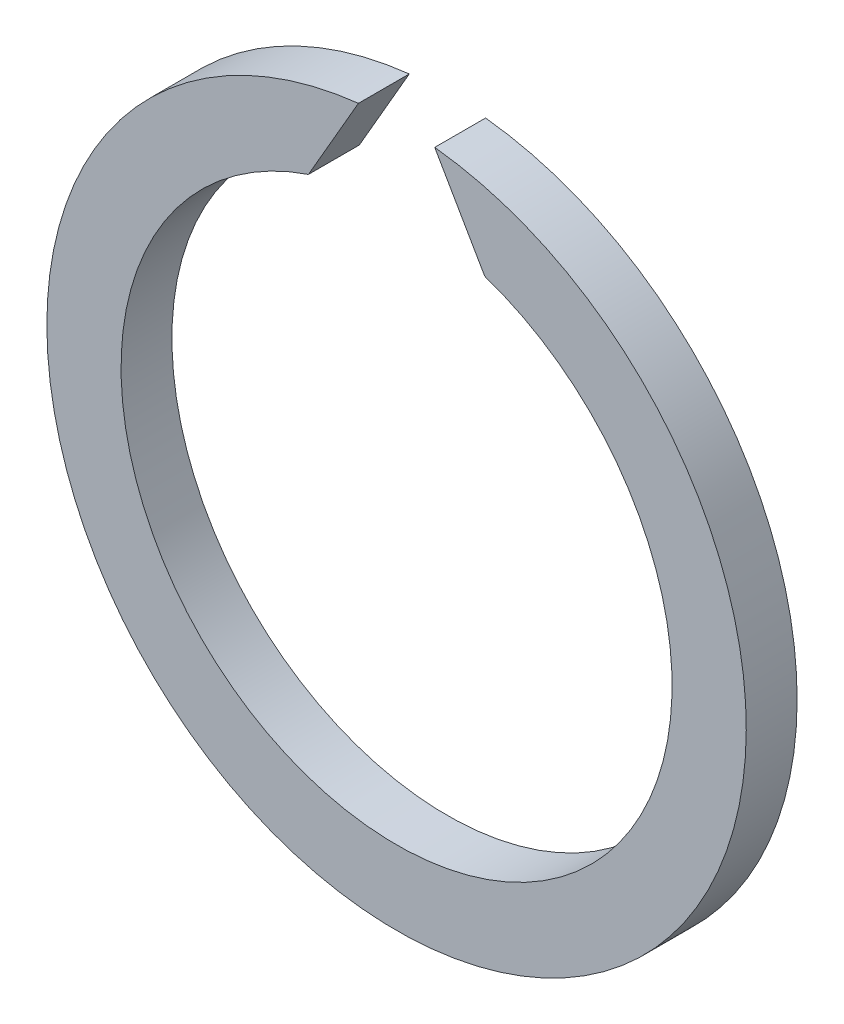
ISO-10303-21;
HEADER;
FILE_DESCRIPTION(('STEP AP214'),'2;1');
FILE_NAME('part.step','',(''),(''),'','','');
FILE_SCHEMA(('AUTOMOTIVE_DESIGN { 1 0 10303 214 1 1 1 1 }'));
ENDSEC;
DATA;
#1=APPLICATION_CONTEXT('core data for automotive mechanical design processes');
#2=APPLICATION_PROTOCOL_DEFINITION('international standard','automotive_design',2000,#1);
#3=PRODUCT_CONTEXT('',#1,'mechanical');
#4=PRODUCT('Part','Part','',(#3));
#5=PRODUCT_RELATED_PRODUCT_CATEGORY('part','',(#4));
#6=PRODUCT_DEFINITION_FORMATION('','',#4);
#7=PRODUCT_DEFINITION_CONTEXT('part definition',#1,'design');
#8=PRODUCT_DEFINITION('design','',#6,#7);
#9=PRODUCT_DEFINITION_SHAPE('','',#8);
#10=(LENGTH_UNIT() NAMED_UNIT(*) SI_UNIT(.MILLI.,.METRE.));
#11=(NAMED_UNIT(*) PLANE_ANGLE_UNIT() SI_UNIT($,.RADIAN.));
#12=(NAMED_UNIT(*) SI_UNIT($,.STERADIAN.) SOLID_ANGLE_UNIT());
#13=UNCERTAINTY_MEASURE_WITH_UNIT(LENGTH_MEASURE(1.E-05),#10,'distance_accuracy_value','');
#14=(GEOMETRIC_REPRESENTATION_CONTEXT(3) GLOBAL_UNCERTAINTY_ASSIGNED_CONTEXT((#13)) GLOBAL_UNIT_ASSIGNED_CONTEXT((#10,
#11,#12)) REPRESENTATION_CONTEXT('',''));
#15=CARTESIAN_POINT('',(0.,0.,0.));
#16=DIRECTION('',(0.,0.,1.));
#17=DIRECTION('',(1.,0.,0.));
#18=AXIS2_PLACEMENT_3D('',#15,#16,#17);
#19=CARTESIAN_POINT('',(0.,0.,1.2));
#20=DIRECTION('',(0.,0.,-1.));
#21=DIRECTION('',(-1.,0.,0.));
#22=AXIS2_PLACEMENT_3D('',#19,#20,#21);
#23=CYLINDRICAL_SURFACE('',#22,6.5);
#24=CARTESIAN_POINT('',(0.,0.,0.));
#25=DIRECTION('',(0.,0.,-1.));
#26=DIRECTION('',(1.,0.,0.));
#27=AXIS2_PLACEMENT_3D('',#24,#25,#26);
#28=CIRCLE('',#27,6.5);
#29=CARTESIAN_POINT('',(2.07908789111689,6.1585220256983,0.));
#30=VERTEX_POINT('',#29);
#31=CARTESIAN_POINT('',(-2.07908789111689,6.1585220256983,0.));
#32=VERTEX_POINT('',#31);
#33=EDGE_CURVE('E100',#30,#32,#28,.T.);
#34=ORIENTED_EDGE('',*,*,#33,.T.);
#35=DIRECTION('',(0.,0.,-1.));
#36=VECTOR('',#35,1.);
#37=CARTESIAN_POINT('',(-2.07908789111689,6.1585220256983,1.2));
#38=LINE('',#37,#36);
#39=CARTESIAN_POINT('',(-2.07908789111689,6.1585220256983,1.2));
#40=VERTEX_POINT('',#39);
#41=EDGE_CURVE('E11',#40,#32,#38,.T.);
#42=ORIENTED_EDGE('',*,*,#41,.F.);
#43=CARTESIAN_POINT('',(0.,0.,1.2));
#44=DIRECTION('',(0.,0.,-1.));
#45=DIRECTION('',(1.,0.,0.));
#46=AXIS2_PLACEMENT_3D('',#43,#44,#45);
#47=CIRCLE('',#46,6.5);
#48=CARTESIAN_POINT('',(2.07908789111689,6.1585220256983,1.2));
#49=VERTEX_POINT('',#48);
#50=EDGE_CURVE('E88',#49,#40,#47,.T.);
#51=ORIENTED_EDGE('',*,*,#50,.F.);
#52=DIRECTION('',(0.,0.,-1.));
#53=VECTOR('',#52,1.);
#54=CARTESIAN_POINT('',(2.07908789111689,6.1585220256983,1.2));
#55=LINE('',#54,#53);
#56=EDGE_CURVE('E96',#49,#30,#55,.T.);
#57=ORIENTED_EDGE('',*,*,#56,.T.);
#58=EDGE_LOOP('',(#34,#42,#51,#57));
#59=FACE_BOUND('',#58,.T.);
#60=ADVANCED_FACE('F37',(#59),#23,.F.);
#61=CARTESIAN_POINT('',(-2.07908789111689,6.1585220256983,1.2));
#62=DIRECTION('',(-0.866025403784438,0.500000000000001,0.));
#63=DIRECTION('',(-0.500000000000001,-0.866025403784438,0.));
#64=AXIS2_PLACEMENT_3D('',#61,#62,#63);
#65=PLANE('',#64);
#66=DIRECTION('',(0.500000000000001,0.866025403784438,0.));
#67=VECTOR('',#66,1.);
#68=CARTESIAN_POINT('',(-2.07908789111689,6.1585220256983,0.));
#69=LINE('',#68,#67);
#70=CARTESIAN_POINT('',(-0.9,8.20076215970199,0.));
#71=VERTEX_POINT('',#70);
#72=EDGE_CURVE('E92',#32,#71,#69,.T.);
#73=ORIENTED_EDGE('',*,*,#72,.T.);
#74=DIRECTION('',(0.,0.,-1.));
#75=VECTOR('',#74,1.);
#76=CARTESIAN_POINT('',(-0.9,8.20076215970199,1.2));
#77=LINE('',#76,#75);
#78=CARTESIAN_POINT('',(-0.9,8.20076215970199,1.2));
#79=VERTEX_POINT('',#78);
#80=EDGE_CURVE('E45',#79,#71,#77,.T.);
#81=ORIENTED_EDGE('',*,*,#80,.F.);
#82=DIRECTION('',(0.500000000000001,0.866025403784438,0.));
#83=VECTOR('',#82,1.);
#84=CARTESIAN_POINT('',(-2.07908789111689,6.1585220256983,1.2));
#85=LINE('',#84,#83);
#86=EDGE_CURVE('E83',#40,#79,#85,.T.);
#87=ORIENTED_EDGE('',*,*,#86,.F.);
#88=ORIENTED_EDGE('',*,*,#41,.T.);
#89=EDGE_LOOP('',(#73,#81,#87,#88));
#90=FACE_BOUND('',#89,.T.);
#91=ADVANCED_FACE('F91',(#90),#65,.F.);
#92=CARTESIAN_POINT('',(0.,0.,1.2));
#93=DIRECTION('',(0.,0.,-1.));
#94=DIRECTION('',(-1.,0.,0.));
#95=AXIS2_PLACEMENT_3D('',#92,#93,#94);
#96=CYLINDRICAL_SURFACE('',#95,8.25);
#97=CARTESIAN_POINT('',(0.,0.,0.));
#98=DIRECTION('',(0.,0.,1.));
#99=DIRECTION('',(1.,0.,0.));
#100=AXIS2_PLACEMENT_3D('',#97,#98,#99);
#101=CIRCLE('',#100,8.25);
#102=CARTESIAN_POINT('',(0.9,8.20076215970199,0.));
#103=VERTEX_POINT('',#102);
#104=EDGE_CURVE('E70',#71,#103,#101,.T.);
#105=ORIENTED_EDGE('',*,*,#104,.T.);
#106=DIRECTION('',(0.,0.,-1.));
#107=VECTOR('',#106,1.);
#108=CARTESIAN_POINT('',(0.9,8.20076215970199,1.2));
#109=LINE('',#108,#107);
#110=CARTESIAN_POINT('',(0.9,8.20076215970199,1.2));
#111=VERTEX_POINT('',#110);
#112=EDGE_CURVE('E93',#111,#103,#109,.T.);
#113=ORIENTED_EDGE('',*,*,#112,.F.);
#114=CARTESIAN_POINT('',(0.,0.,1.2));
#115=DIRECTION('',(0.,0.,1.));
#116=DIRECTION('',(1.,0.,0.));
#117=AXIS2_PLACEMENT_3D('',#114,#115,#116);
#118=CIRCLE('',#117,8.25);
#119=EDGE_CURVE('E86',#79,#111,#118,.T.);
#120=ORIENTED_EDGE('',*,*,#119,.F.);
#121=ORIENTED_EDGE('',*,*,#80,.T.);
#122=EDGE_LOOP('',(#105,#113,#120,#121));
#123=FACE_BOUND('',#122,.T.);
#124=ADVANCED_FACE('F94',(#123),#96,.T.);
#125=CARTESIAN_POINT('',(2.07908789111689,6.1585220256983,1.2));
#126=DIRECTION('',(0.866025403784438,0.500000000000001,0.));
#127=DIRECTION('',(-0.500000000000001,0.866025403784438,0.));
#128=AXIS2_PLACEMENT_3D('',#125,#126,#127);
#129=PLANE('',#128);
#130=DIRECTION('',(0.500000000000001,-0.866025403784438,0.));
#131=VECTOR('',#130,1.);
#132=CARTESIAN_POINT('',(2.07908789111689,6.1585220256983,0.));
#133=LINE('',#132,#131);
#134=EDGE_CURVE('E76',#103,#30,#133,.T.);
#135=ORIENTED_EDGE('',*,*,#134,.T.);
#136=ORIENTED_EDGE('',*,*,#56,.F.);
#137=DIRECTION('',(0.500000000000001,-0.866025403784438,0.));
#138=VECTOR('',#137,1.);
#139=CARTESIAN_POINT('',(2.07908789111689,6.1585220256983,1.2));
#140=LINE('',#139,#138);
#141=EDGE_CURVE('E53',#111,#49,#140,.T.);
#142=ORIENTED_EDGE('',*,*,#141,.F.);
#143=ORIENTED_EDGE('',*,*,#112,.T.);
#144=EDGE_LOOP('',(#135,#136,#142,#143));
#145=FACE_BOUND('',#144,.T.);
#146=ADVANCED_FACE('F107',(#145),#129,.F.);
#147=CARTESIAN_POINT('',(0.,0.,1.2));
#148=DIRECTION('',(0.,0.,1.));
#149=DIRECTION('',(1.,0.,0.));
#150=AXIS2_PLACEMENT_3D('',#147,#148,#149);
#151=PLANE('',#150);
#152=ORIENTED_EDGE('',*,*,#50,.T.);
#153=ORIENTED_EDGE('',*,*,#86,.T.);
#154=ORIENTED_EDGE('',*,*,#119,.T.);
#155=ORIENTED_EDGE('',*,*,#141,.T.);
#156=EDGE_LOOP('',(#152,#153,#154,#155));
#157=FACE_BOUND('',#156,.T.);
#158=ADVANCED_FACE('F84',(#157),#151,.T.);
#159=CARTESIAN_POINT('',(0.,0.,0.));
#160=DIRECTION('',(0.,0.,1.));
#161=DIRECTION('',(1.,0.,0.));
#162=AXIS2_PLACEMENT_3D('',#159,#160,#161);
#163=PLANE('',#162);
#164=ORIENTED_EDGE('',*,*,#33,.F.);
#165=ORIENTED_EDGE('',*,*,#134,.F.);
#166=ORIENTED_EDGE('',*,*,#104,.F.);
#167=ORIENTED_EDGE('',*,*,#72,.F.);
#168=EDGE_LOOP('',(#164,#165,#166,#167));
#169=FACE_BOUND('',#168,.T.);
#170=ADVANCED_FACE('F110',(#169),#163,.F.);
#171=CLOSED_SHELL('',(#60,#91,#124,#146,#158,#170));
#172=MANIFOLD_SOLID_BREP('B2',#171);
#173=ADVANCED_BREP_SHAPE_REPRESENTATION('',(#18,#172),#14);
#174=SHAPE_DEFINITION_REPRESENTATION(#9,#173);
ENDSEC;
END-ISO-10303-21;
